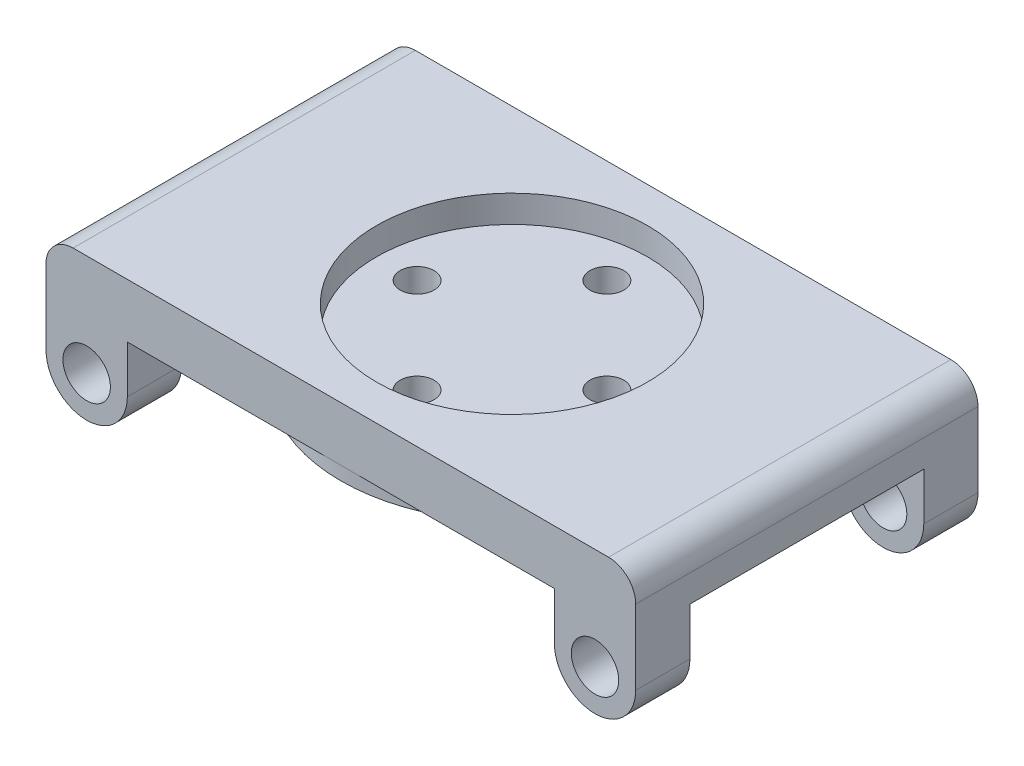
from build123d import *

# Parameters (mm, degrees)
SKETCH1_W           = 43.5
SKETCH1_H           = 25.25
BOSS_EXTRUDE1_DEPTH = 4
SKETCH5_R           = 10
CUT_EXTRUDE3_DEPTH  = 2
SKETCH6_R           = 12.625
BOSS_EXTRUDE3_DEPTH = 1
SKETCH2_R           = 1.25
CUT_EXTRUDE4_DEPTH  = 26.640848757
SKETCH4_R           = 1.75
BOSS_EXTRUDE2_DEPTH = 4
FILLET1_R           = 2


with BuildPart() as part:
    # Sketch1 → Boss-Extrude1 (new body)
    with BuildSketch(Plane(origin=(0, 0, 0), x_dir=(1, 0, 0), z_dir=(0, 1, 0))):
        Rectangle(SKETCH1_W, SKETCH1_H)
    extrude(amount=BOSS_EXTRUDE1_DEPTH)

    # Sketch5 → Cut-Extrude3 (cut)
    with BuildSketch(Plane(origin=(0, 4, 0), x_dir=(1, 0, 0), z_dir=(0, 1, 0))):
        with Locations(Location((0, 0, 0), (0, 0, 270))):
            Circle(SKETCH5_R)
    extrude(amount=-CUT_EXTRUDE3_DEPTH, mode=Mode.SUBTRACT)

    # Sketch6 → Boss-Extrude3 (add)
    with BuildSketch(Plane.XZ):
        with Locations(Location((0, 0, 0), (0, 0, 270))):
            Circle(SKETCH6_R)
    extrude(amount=BOSS_EXTRUDE3_DEPTH)

    # Sketch2 → Cut-Extrude4 (cut, through all)
    with BuildSketch(Plane(origin=(0, 4, 0), x_dir=(1, 0, 0), z_dir=(0, 1, 0))):
        with Locations(Location((0, 7, 0), (0, 0, 270))):
            Circle(SKETCH2_R)
        with Locations(Location((7, 0, 0), (0, 0, 270))):
            Circle(SKETCH2_R)
        with Locations(Location((0, -7, 0), (0, 0, 270))):
            Circle(SKETCH2_R)
        with Locations(Location((-7, 0, 0), (0, 0, 270))):
            Circle(SKETCH2_R)
    extrude(amount=-CUT_EXTRUDE4_DEPTH, mode=Mode.SUBTRACT)

    # Sketch4 → Boss-Extrude2 (add)
    # profile 1 of 2: a face of its own
    with BuildSketch(Plane.XY.offset(12.625)):
        with BuildLine():
            Line((-21.75, 0), (-15.75, 0))
            Line((-15.75, 0), (-15.75, -3.5))
            ThreePointArc((-15.75, -3.5), (-18.75, -6.5), (-21.75, -3.5))
            Line((-21.75, -3.5), (-21.75, 0))
        make_face()
        with Locations((-18.75, -3.5)):
            Circle(SKETCH4_R, mode=Mode.SUBTRACT)
    # profile 2 of 2: a face of its own
    with BuildSketch(Plane.XY.offset(12.625)):
        with BuildLine():
            Line((21.75, 0), (21.75, -3.5))
            ThreePointArc((21.75, -3.5), (18.75, -6.5), (15.75, -3.5))
            Line((15.75, -3.5), (15.75, 0))
            Line((15.75, 0), (21.75, 0))
        make_face()
        with Locations((18.75, -3.5)):
            Circle(SKETCH4_R, mode=Mode.SUBTRACT)
    boss_extrude2 = extrude(amount=-BOSS_EXTRUDE2_DEPTH)

    # Mirror1: Boss-Extrude2 across plane
    add(boss_extrude2.mirror(Plane.XY))

    # Fillet1
    fillet1_edges = [part.edges().sort_by_distance(p)[0] for p in [
        (-21.75, 4, 0),
        (21.75, 4, 0),
    ]]
    fillet(fillet1_edges, radius=FILLET1_R)


solid = part.part
